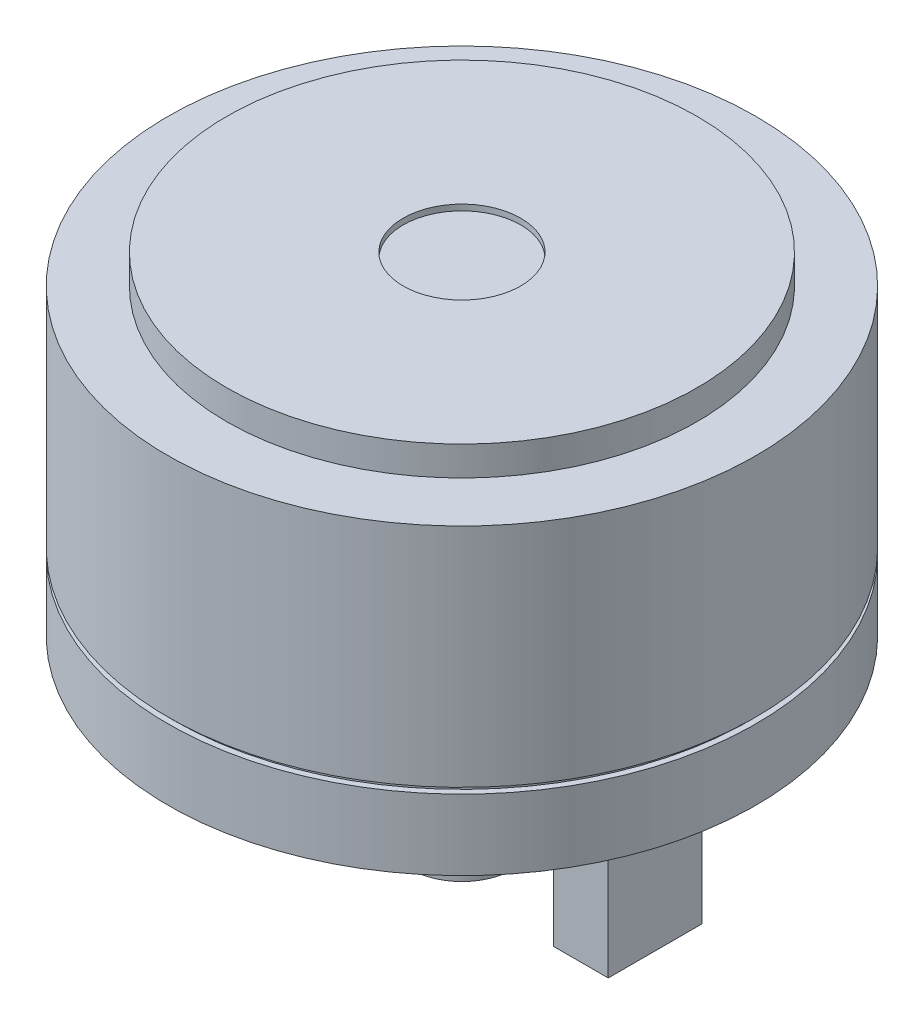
from build123d import *

# Parameters (mm, degrees)
SKETCH2_R           = 0.881235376
SKETCH2_W           = 0.934333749
SKETCH2_H           = 1.597727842
BOSS_EXTRUDE1_DEPTH = 3


with BuildPart() as part:
    # Sketch1 → Revolve1 (revolve)
    with BuildSketch(Plane(origin=(0, 0, 0), x_dir=(0, 0, -1), z_dir=(1, 0, 0))):
        Polygon((0, 5.55), (1, 5.55), (1, 5.65), (4, 5.65), (4, 5.15), (5, 5.15), (5, 1.3), (4.9, 1.3), (4.9, 1.2), (5, 1.2), (5, 0), (0, 0), align=None)
    revolve(axis=Axis((0, 0, 0), (0, 1, 0)))

    # Sketch2 → Boss-Extrude1 (add)
    with BuildSketch(Plane.XZ):
        with Locations(Location((0, 0, 0), (0, 0, 270))):
            Circle(SKETCH2_R)
        with Locations((-2.82019351, 0)):
            Rectangle(SKETCH2_W, SKETCH2_H)
        with Locations((2.82019351, 0)):
            Rectangle(SKETCH2_W, SKETCH2_H)
    extrude(amount=BOSS_EXTRUDE1_DEPTH)


solid = part.part
